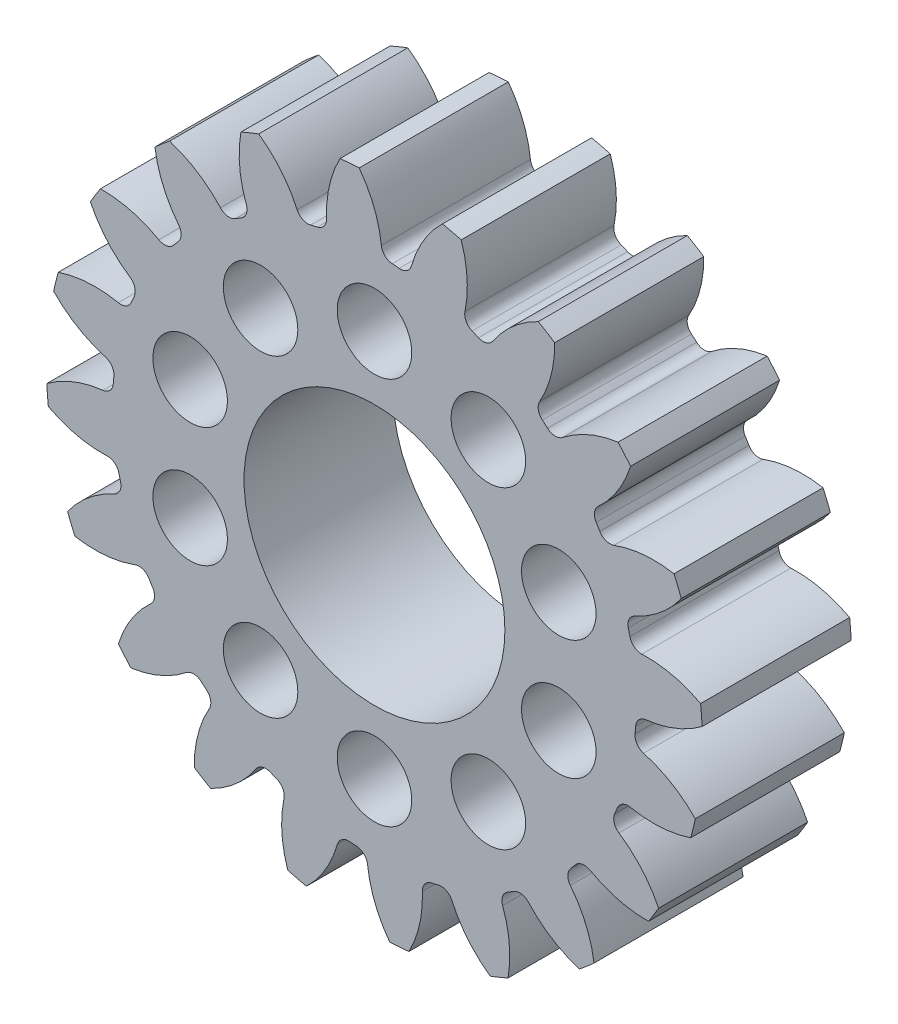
from build123d import *

# Parameters (mm, degrees)
SKETCH3_R          = 27.94
GEARBODY_DEPTH     = 12.7
TOOTHCUT_DEPTH     = 42.503941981
CIRPATTERN1_COUNT  = 20
BOREDIA_R          = 11.1125
BORE_DEPTH         = 12700
SKETCH4_R          = 3.175
CUT_EXTRUDE2_DEPTH = 42.463206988


with BuildPart() as part:
    # Sketch3 → gearBody (new body)
    with BuildSketch(Plane.XY):
        Circle(SKETCH3_R)
    extrude(amount=GEARBODY_DEPTH)

    # Sketch2 → toothCut (cut, through all)
    with BuildSketch(Plane.XY):
        with BuildLine():
            ThreePointArc((22.201642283, -2.104899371), (22.227721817, -1.808840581), (22.249853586, -1.51246053))
            ThreePointArc((22.249853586, -1.51246053), (22.524863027, -0.889704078), (23.135176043, -0.588085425))
            ThreePointArc((23.135176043, -0.588085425), (27.094327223, 0.75176996), (30.13280901, 3.621912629))
            ThreePointArc((30.13280901, 3.621912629), (30.249705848, -2.461651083), (29.150728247, -8.446269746))
            ThreePointArc((29.150728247, -8.446269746), (26.616283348, -5.122615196), (22.925858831, -3.160255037))
            ThreePointArc((22.925858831, -3.160255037), (22.372343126, -2.763926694), (22.201642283, -2.104899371))
        make_face()
    toothcut = extrude(amount=TOOTHCUT_DEPTH, mode=Mode.SUBTRACT)

    # CirPattern1: toothCut ×20 about axis
    cirpattern1_axis = Axis((0, 0, 0), (0, 0, 1))
    for i in range(1, CIRPATTERN1_COUNT):
        add(toothcut.rotate(cirpattern1_axis, i * 360 / CIRPATTERN1_COUNT), mode=Mode.SUBTRACT)

    # boreDia → bore (cut, symmetric)
    with BuildSketch(Plane.XY):
        Circle(BOREDIA_R)
    extrude(amount=BORE_DEPTH, both=True, mode=Mode.SUBTRACT)

    # Sketch4 → Cut-Extrude2 (cut, through all)
    with BuildSketch(Plane.XY.offset(12.7)):
        with Locations((0, -16.51)):
            Circle(SKETCH4_R)
        with Locations((-9.704334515, -13.356870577)):
            Circle(SKETCH4_R)
        with Locations((-15.701943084, -5.101870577)):
            Circle(SKETCH4_R)
        with Locations((-15.701943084, 5.101870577)):
            Circle(SKETCH4_R)
        with Locations((-9.704334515, 13.356870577)):
            Circle(SKETCH4_R)
        with Locations((0, 16.51)):
            Circle(SKETCH4_R)
        with Locations((9.704334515, 13.356870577)):
            Circle(SKETCH4_R)
        with Locations((15.701943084, 5.101870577)):
            Circle(SKETCH4_R)
        with Locations((15.701943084, -5.101870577)):
            Circle(SKETCH4_R)
        with Locations((9.704334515, -13.356870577)):
            Circle(SKETCH4_R)
    extrude(amount=-CUT_EXTRUDE2_DEPTH, mode=Mode.SUBTRACT)


solid = part.part
